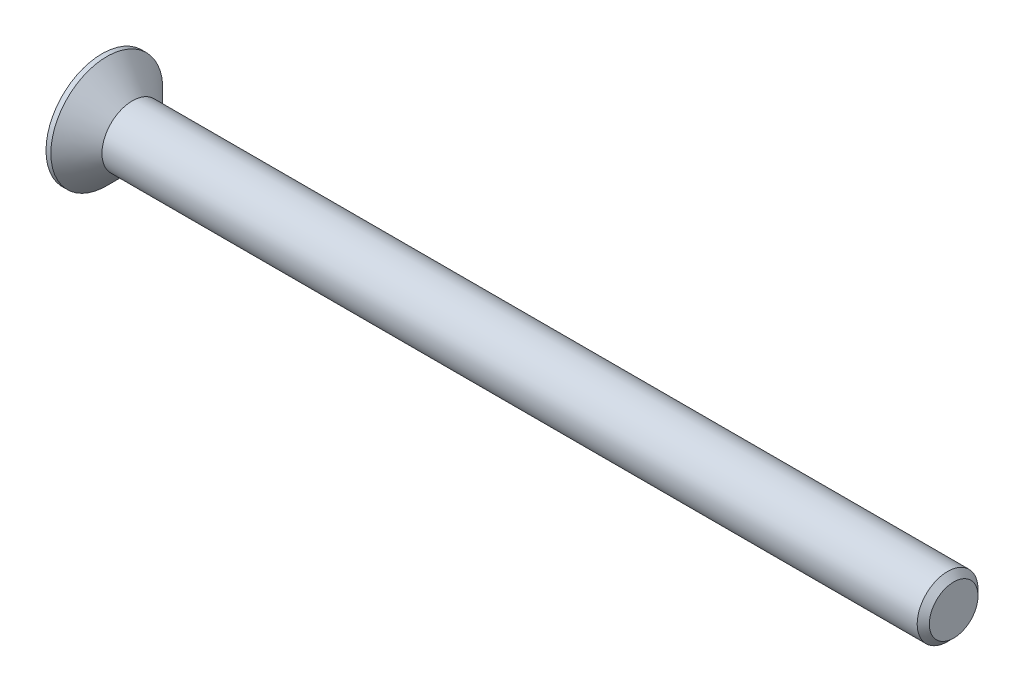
from build123d import *

# Parameters (mm, degrees)
CHAMFER1_SIZE      = 0.5
CUT_EXTRUDE1_DEPTH = 2.1


with BuildPart() as part:
    # Sketch1 → Revolve1 (revolve)
    with BuildSketch(Plane.XY, mode=Mode.PRIVATE) as revolve1_sk:
        Polygon((-2.5, 4.6), (-2.5, 0), (67.5, 0), (67.5, 2.5), (0, 2.5), (-2.1, 4.6), align=None)
    revolve(revolve1_sk.sketch.rotate(Axis((-2.5, 0, 0), (1, 0, 0)), 90), axis=Axis((-2.5, 0, 0), (1, 0, 0)))

    # Chamfer1
    chamfer1_edges = [part.edges().sort_by_distance(p)[0] for p in [
        (67.5, 0, -2.5),
    ]]
    chamfer(chamfer1_edges, length=CHAMFER1_SIZE)

    # Sketch2 → Cut-Extrude1 (cut)
    with BuildSketch(Plane.ZY.offset(2.5)):
        Polygon((-0.575, 2.3), (0.575, 2.3), (0.575, 0.575), (2.3, 0.575), (2.3, -0.575), (0.575, -0.575), (0.575, -2.3), (-0.575, -2.3), (-0.575, -0.575), (-2.3, -0.575), (-2.3, 0.575), (-0.575, 0.575), align=None)
    extrude(amount=-CUT_EXTRUDE1_DEPTH, mode=Mode.SUBTRACT)


solid = part.part
